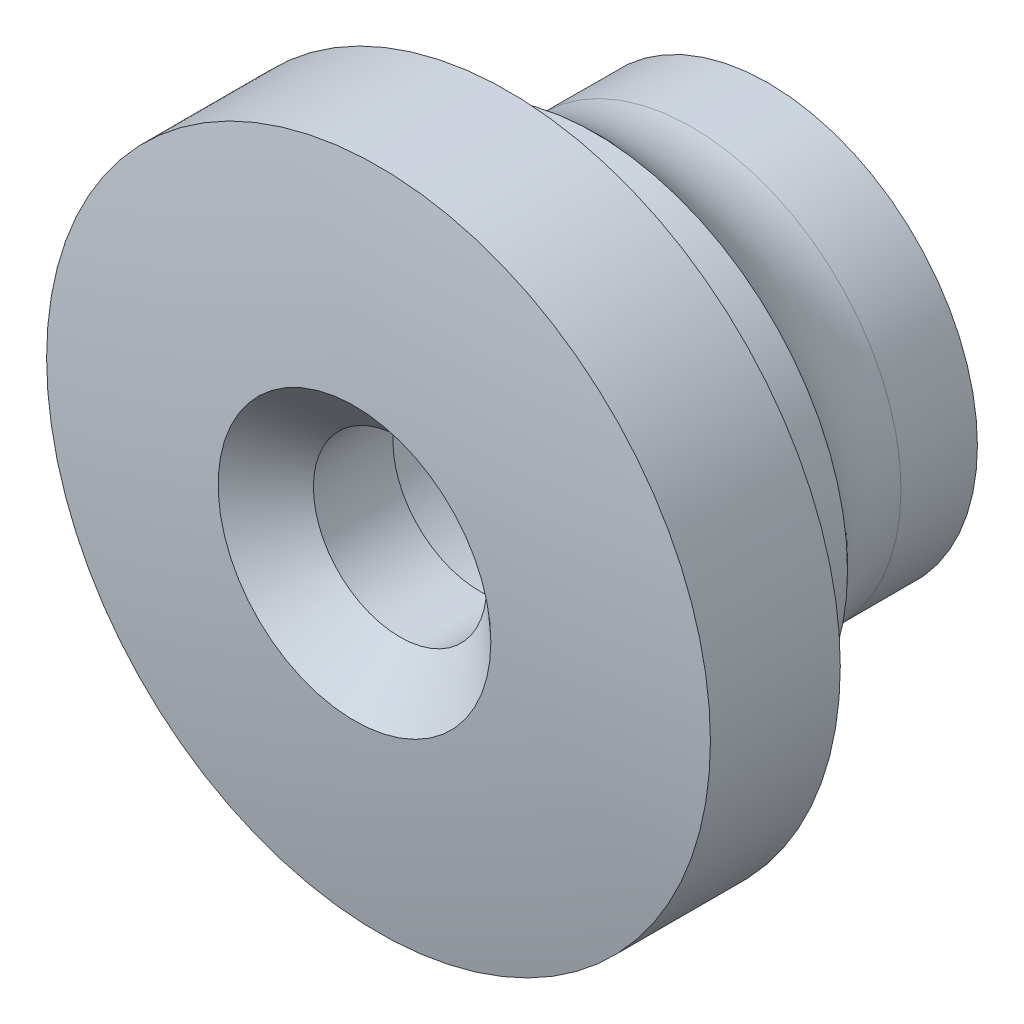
ISO-10303-21;
HEADER;
FILE_DESCRIPTION(('STEP AP214'),'2;1');
FILE_NAME('part.step','',(''),(''),'','','');
FILE_SCHEMA(('AUTOMOTIVE_DESIGN { 1 0 10303 214 1 1 1 1 }'));
ENDSEC;
DATA;
#1=APPLICATION_CONTEXT('core data for automotive mechanical design processes');
#2=APPLICATION_PROTOCOL_DEFINITION('international standard','automotive_design',2000,#1);
#3=PRODUCT_CONTEXT('',#1,'mechanical');
#4=PRODUCT('Part','Part','',(#3));
#5=PRODUCT_RELATED_PRODUCT_CATEGORY('part','',(#4));
#6=PRODUCT_DEFINITION_FORMATION('','',#4);
#7=PRODUCT_DEFINITION_CONTEXT('part definition',#1,'design');
#8=PRODUCT_DEFINITION('design','',#6,#7);
#9=PRODUCT_DEFINITION_SHAPE('','',#8);
#10=(LENGTH_UNIT() NAMED_UNIT(*) SI_UNIT(.MILLI.,.METRE.));
#11=(NAMED_UNIT(*) PLANE_ANGLE_UNIT() SI_UNIT($,.RADIAN.));
#12=(NAMED_UNIT(*) SI_UNIT($,.STERADIAN.) SOLID_ANGLE_UNIT());
#13=UNCERTAINTY_MEASURE_WITH_UNIT(LENGTH_MEASURE(1.E-05),#10,'distance_accuracy_value','');
#14=(GEOMETRIC_REPRESENTATION_CONTEXT(3) GLOBAL_UNCERTAINTY_ASSIGNED_CONTEXT((#13)) GLOBAL_UNIT_ASSIGNED_CONTEXT((#10,
#11,#12)) REPRESENTATION_CONTEXT('',''));
#15=CARTESIAN_POINT('',(0.,0.,0.));
#16=DIRECTION('',(0.,0.,1.));
#17=DIRECTION('',(1.,0.,0.));
#18=AXIS2_PLACEMENT_3D('',#15,#16,#17);
#19=CARTESIAN_POINT('',(0.,0.,0.));
#20=DIRECTION('',(0.,0.,-1.));
#21=DIRECTION('',(-1.,0.,0.));
#22=AXIS2_PLACEMENT_3D('',#19,#20,#21);
#23=CYLINDRICAL_SURFACE('',#22,3.00000000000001);
#24=CARTESIAN_POINT('',(0.,0.,3.75620056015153));
#25=DIRECTION('',(0.,0.,1.));
#26=DIRECTION('',(1.,0.,0.));
#27=AXIS2_PLACEMENT_3D('',#24,#25,#26);
#28=CIRCLE('',#27,3.00000000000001);
#29=CARTESIAN_POINT('',(3.00000000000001,0.,3.75620056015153));
#30=VERTEX_POINT('',#29);
#31=EDGE_CURVE('E51',#30,#30,#28,.T.);
#32=ORIENTED_EDGE('',*,*,#31,.T.);
#33=EDGE_LOOP('',(#32));
#34=FACE_BOUND('',#33,.T.);
#35=CARTESIAN_POINT('',(0.,0.,0.999999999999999));
#36=DIRECTION('',(0.,0.,-1.));
#37=DIRECTION('',(-1.,0.,0.));
#38=AXIS2_PLACEMENT_3D('',#35,#36,#37);
#39=CIRCLE('',#38,3.00000000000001);
#40=CARTESIAN_POINT('',(-3.00000000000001,0.,0.999999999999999));
#41=VERTEX_POINT('',#40);
#42=EDGE_CURVE('E38',#41,#41,#39,.F.);
#43=ORIENTED_EDGE('',*,*,#42,.F.);
#44=EDGE_LOOP('',(#43));
#45=FACE_BOUND('',#44,.T.);
#46=ADVANCED_FACE('F34',(#34,#45),#23,.F.);
#47=CARTESIAN_POINT('',(0.,0.,0.));
#48=DIRECTION('',(0.,0.,1.));
#49=DIRECTION('',(1.,0.,0.));
#50=AXIS2_PLACEMENT_3D('',#47,#48,#49);
#51=PLANE('',#50);
#52=CARTESIAN_POINT('',(0.,0.,0.));
#53=DIRECTION('',(0.,0.,1.));
#54=DIRECTION('',(1.,0.,0.));
#55=AXIS2_PLACEMENT_3D('',#52,#53,#54);
#56=CIRCLE('',#55,11.5);
#57=CARTESIAN_POINT('',(11.5,0.,0.));
#58=VERTEX_POINT('',#57);
#59=EDGE_CURVE('E57',#58,#58,#56,.T.);
#60=ORIENTED_EDGE('',*,*,#59,.F.);
#61=EDGE_LOOP('',(#60));
#62=FACE_BOUND('',#61,.T.);
#63=CARTESIAN_POINT('',(0.,0.,0.));
#64=DIRECTION('',(0.,0.,1.));
#65=DIRECTION('',(1.,0.,0.));
#66=AXIS2_PLACEMENT_3D('',#63,#64,#65);
#67=CIRCLE('',#66,8.75);
#68=CARTESIAN_POINT('',(8.75,0.,0.));
#69=VERTEX_POINT('',#68);
#70=EDGE_CURVE('E42',#69,#69,#67,.F.);
#71=ORIENTED_EDGE('',*,*,#70,.F.);
#72=EDGE_LOOP('',(#71));
#73=FACE_BOUND('',#72,.T.);
#74=ADVANCED_FACE('F79',(#62,#73),#51,.F.);
#75=CARTESIAN_POINT('',(0.,0.,4.5));
#76=DIRECTION('',(0.,0.,-1.));
#77=DIRECTION('',(-1.,0.,0.));
#78=AXIS2_PLACEMENT_3D('',#75,#76,#77);
#79=CYLINDRICAL_SURFACE('',#78,11.5);
#80=CARTESIAN_POINT('',(0.,0.,4.5));
#81=DIRECTION('',(0.,0.,1.));
#82=DIRECTION('',(1.,0.,0.));
#83=AXIS2_PLACEMENT_3D('',#80,#81,#82);
#84=CIRCLE('',#83,11.5);
#85=CARTESIAN_POINT('',(11.5,0.,4.50000000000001));
#86=VERTEX_POINT('',#85);
#87=EDGE_CURVE('E54',#86,#86,#84,.T.);
#88=ORIENTED_EDGE('',*,*,#87,.F.);
#89=EDGE_LOOP('',(#88));
#90=FACE_BOUND('',#89,.T.);
#91=ORIENTED_EDGE('',*,*,#59,.T.);
#92=EDGE_LOOP('',(#91));
#93=FACE_BOUND('',#92,.T.);
#94=ADVANCED_FACE('F85',(#90,#93),#79,.T.);
#95=CARTESIAN_POINT('',(0.,0.,-61.125));
#96=DIRECTION('',(0.,0.,1.));
#97=DIRECTION('',(1.,0.,0.));
#98=AXIS2_PLACEMENT_3D('',#95,#96,#97);
#99=SPHERICAL_SURFACE('',#98,66.625);
#100=CARTESIAN_POINT('',(0.,0.,5.33225349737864));
#101=DIRECTION('',(0.,0.,-1.));
#102=DIRECTION('',(-1.,0.,0.));
#103=AXIS2_PLACEMENT_3D('',#100,#101,#102);
#104=CIRCLE('',#103,4.72483677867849);
#105=CARTESIAN_POINT('',(4.72483677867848,0.,5.33225349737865));
#106=VERTEX_POINT('',#105);
#107=EDGE_CURVE('E46',#106,#106,#104,.T.);
#108=CARTESIAN_POINT('',(4.72483677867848,0.,5.33225349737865));
#109=CARTESIAN_POINT('',(4.79579389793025,0.,5.32720873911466));
#110=CARTESIAN_POINT('',(4.86674293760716,0.,5.32205033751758));
#111=CARTESIAN_POINT('',(5.00862413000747,0.,5.31150630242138));
#112=CARTESIAN_POINT('',(5.07955628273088,0.,5.30612066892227));
#113=CARTESIAN_POINT('',(5.22140297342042,0.,5.29512222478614));
#114=CARTESIAN_POINT('',(5.29231751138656,0.,5.28950941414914));
#115=CARTESIAN_POINT('',(5.43412824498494,0.,5.27805667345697));
#116=CARTESIAN_POINT('',(5.5050244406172,0.,5.2722167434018));
#117=CARTESIAN_POINT('',(5.64679776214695,0.,5.26030982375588));
#118=CARTESIAN_POINT('',(5.71767488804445,0.,5.25424283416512));
#119=CARTESIAN_POINT('',(5.85940934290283,0.,5.24188185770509));
#120=CARTESIAN_POINT('',(5.93026667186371,0.,5.23558787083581));
#121=CARTESIAN_POINT('',(6.0719608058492,0.,5.22277296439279));
#122=CARTESIAN_POINT('',(6.14279761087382,0.,5.21625204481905));
#123=CARTESIAN_POINT('',(6.28444997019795,0.,5.20298333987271));
#124=CARTESIAN_POINT('',(6.35526552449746,0.,5.19623555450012));
#125=CARTESIAN_POINT('',(6.49687465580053,0.,5.18251318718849));
#126=CARTESIAN_POINT('',(6.56766823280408,0.,5.17553860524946));
#127=CARTESIAN_POINT('',(6.70923268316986,0.,5.16136271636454));
#128=CARTESIAN_POINT('',(6.7800035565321,0.,5.15416140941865));
#129=CARTESIAN_POINT('',(6.92152187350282,0.,5.13953214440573));
#130=CARTESIAN_POINT('',(6.99226931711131,0.,5.1321041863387));
#131=CARTESIAN_POINT('',(7.13374004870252,0.,5.11702169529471));
#132=CARTESIAN_POINT('',(7.20446333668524,0.,5.10936716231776));
#133=CARTESIAN_POINT('',(7.34588503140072,0.,5.09383159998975));
#134=CARTESIAN_POINT('',(7.41658343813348,0.,5.0859505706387));
#135=CARTESIAN_POINT('',(7.55795464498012,0.,5.06996209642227));
#136=CARTESIAN_POINT('',(7.628627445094,0.,5.06185465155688));
#137=CARTESIAN_POINT('',(7.7699467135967,0.,5.0454134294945));
#138=CARTESIAN_POINT('',(7.84059318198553,0.,5.0370796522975));
#139=CARTESIAN_POINT('',(7.9818590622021,0.,5.02018585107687));
#140=CARTESIAN_POINT('',(8.05247847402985,0.,5.01162582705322));
#141=CARTESIAN_POINT('',(8.19368951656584,0.,4.99427962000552));
#142=CARTESIAN_POINT('',(8.26428114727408,0.,4.98549343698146));
#143=CARTESIAN_POINT('',(8.4054359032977,0.,4.96769500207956));
#144=CARTESIAN_POINT('',(8.47599902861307,0.,4.95868275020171));
#145=CARTESIAN_POINT('',(8.61709604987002,0.,4.94043227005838));
#146=CARTESIAN_POINT('',(8.68762994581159,0.,4.9311940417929));
#147=CARTESIAN_POINT('',(8.82866778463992,0.,4.91249170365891));
#148=CARTESIAN_POINT('',(8.89917172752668,0.,4.90302759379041));
#149=CARTESIAN_POINT('',(9.04014893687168,0.,4.8838735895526));
#150=CARTESIAN_POINT('',(9.11062220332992,0.,4.87418369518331));
#151=CARTESIAN_POINT('',(9.25153733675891,0.,4.85457822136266));
#152=CARTESIAN_POINT('',(9.32197920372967,0.,4.84466264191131));
#153=CARTESIAN_POINT('',(9.46283081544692,0.,4.82460589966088));
#154=CARTESIAN_POINT('',(9.5332405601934,0.,4.81446473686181));
#155=CARTESIAN_POINT('',(9.67402720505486,0.,4.79395693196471));
#156=CARTESIAN_POINT('',(9.74440410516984,0.,4.78359028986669));
#157=CARTESIAN_POINT('',(9.88512433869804,0.,4.7626316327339));
#158=CARTESIAN_POINT('',(9.95546767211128,0.,4.75203961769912));
#159=CARTESIAN_POINT('',(10.0961200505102,0.,4.73063032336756));
#160=CARTESIAN_POINT('',(10.1664290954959,0.,4.71981304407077));
#161=CARTESIAN_POINT('',(10.3070121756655,0.,4.6979533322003));
#162=CARTESIAN_POINT('',(10.3772862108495,0.,4.68691089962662));
#163=CARTESIAN_POINT('',(10.5177985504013,0.,4.66460099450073));
#164=CARTESIAN_POINT('',(10.5880368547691,0.,4.65333352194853));
#165=CARTESIAN_POINT('',(10.7284770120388,0.,4.63057365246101));
#166=CARTESIAN_POINT('',(10.7986788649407,0.,4.61908125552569));
#167=CARTESIAN_POINT('',(10.9390453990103,0.,4.59587165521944));
#168=CARTESIAN_POINT('',(11.0092100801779,0.,4.58415445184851));
#169=CARTESIAN_POINT('',(11.1495015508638,0.,4.56049535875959));
#170=CARTESIAN_POINT('',(11.219628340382,0.,4.54855346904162));
#171=CARTESIAN_POINT('',(11.3598433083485,0.,4.52444512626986));
#172=CARTESIAN_POINT('',(11.4299314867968,0.,4.51227867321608));
#173=CARTESIAN_POINT('',(11.5,0.,4.50000000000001));
#174=B_SPLINE_CURVE_WITH_KNOTS('',3,(#108,#109,#110,#111,#112,#113,#114,#115,#116,#117,#118,
#119,#120,#121,#122,#123,#124,#125,#126,#127,#128,#129,#130,#131,#132,#133,#134,#135,#136,#137,
#138,#139,#140,#141,#142,#143,#144,#145,#146,#147,#148,#149,#150,#151,#152,#153,#154,#155,#156,
#157,#158,#159,#160,#161,#162,#163,#164,#165,#166,#167,#168,#169,#170,#171,#172,#173),
.UNSPECIFIED.,.F.,.F.,(4,2,2,2,2,2,2,2,2,2,2,2,2,2,2,2,2,2,2,2,2,2,2,2,2,2,2,2,2,2,2,2,4),(0.,
0.213408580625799,0.426817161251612,0.640225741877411,0.853634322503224,1.06704290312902,
1.28045148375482,1.49386006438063,1.70726864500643,1.92067722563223,2.13408580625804,
2.34749438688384,2.56090296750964,2.77431154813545,2.98772012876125,3.20112870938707,
3.41453729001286,3.62794587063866,3.84135445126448,4.05476303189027,4.26817161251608,
4.48158019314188,4.69498877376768,4.9083973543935,5.12180593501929,5.33521451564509,
5.54862309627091,5.7620316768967,5.9754402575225,6.18884883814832,6.40225741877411,
6.61566599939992,6.82907458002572),.UNSPECIFIED.);
#175=EDGE_CURVE('BSEAM94',#106,#86,#174,.T.);
#176=ORIENTED_EDGE('',*,*,#107,.T.);
#177=ORIENTED_EDGE('',*,*,#87,.T.);
#178=ORIENTED_EDGE('',*,*,#175,.T.);
#179=ORIENTED_EDGE('',*,*,#175,.F.);
#180=EDGE_LOOP('',(#176,#178,#177,#179));
#181=FACE_BOUND('',#180,.T.);
#182=ADVANCED_FACE('F94',(#181),#99,.T.);
#183=CARTESIAN_POINT('',(0.,0.,3.75620056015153));
#184=DIRECTION('',(0.,0.,1.));
#185=DIRECTION('',(1.,0.,0.));
#186=AXIS2_PLACEMENT_3D('',#183,#184,#185);
#187=CONICAL_SURFACE('',#186,3.00000000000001,0.830441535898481);
#188=ORIENTED_EDGE('',*,*,#107,.F.);
#189=EDGE_LOOP('',(#188));
#190=FACE_BOUND('',#189,.T.);
#191=ORIENTED_EDGE('',*,*,#31,.F.);
#192=EDGE_LOOP('',(#191));
#193=FACE_BOUND('',#192,.T.);
#194=ADVANCED_FACE('F97',(#190,#193),#187,.F.);
#195=CARTESIAN_POINT('',(0.,0.,-3.));
#196=DIRECTION('',(0.,0.,1.));
#197=DIRECTION('',(1.,0.,0.));
#198=AXIS2_PLACEMENT_3D('',#195,#196,#197);
#199=CYLINDRICAL_SURFACE('',#198,8.75);
#200=CARTESIAN_POINT('',(0.,0.,-3.));
#201=DIRECTION('',(0.,0.,-1.));
#202=DIRECTION('',(-1.,0.,0.));
#203=AXIS2_PLACEMENT_3D('',#200,#201,#202);
#204=CIRCLE('',#203,8.75);
#205=CARTESIAN_POINT('',(-8.75,0.,-3.));
#206=VERTEX_POINT('',#205);
#207=EDGE_CURVE('E60',#206,#206,#204,.T.);
#208=ORIENTED_EDGE('',*,*,#207,.F.);
#209=EDGE_LOOP('',(#208));
#210=FACE_BOUND('',#209,.T.);
#211=ORIENTED_EDGE('',*,*,#70,.T.);
#212=EDGE_LOOP('',(#211));
#213=FACE_BOUND('',#212,.T.);
#214=ADVANCED_FACE('F89',(#210,#213),#199,.T.);
#215=CARTESIAN_POINT('',(0.,0.,-9.));
#216=DIRECTION('',(0.,0.,1.));
#217=DIRECTION('',(1.,0.,0.));
#218=AXIS2_PLACEMENT_3D('',#215,#216,#217);
#219=CYLINDRICAL_SURFACE('',#218,7.25);
#220=CARTESIAN_POINT('',(0.,0.,-6.35410196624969));
#221=DIRECTION('',(0.,0.,1.));
#222=DIRECTION('',(1.,0.,0.));
#223=AXIS2_PLACEMENT_3D('',#220,#221,#222);
#224=CIRCLE('',#223,7.25);
#225=CARTESIAN_POINT('',(7.25,0.,-6.35410196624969));
#226=VERTEX_POINT('',#225);
#227=EDGE_CURVE('E10',#226,#226,#224,.F.);
#228=ORIENTED_EDGE('',*,*,#227,.T.);
#229=EDGE_LOOP('',(#228));
#230=FACE_BOUND('',#229,.T.);
#231=CARTESIAN_POINT('',(0.,0.,-9.));
#232=DIRECTION('',(0.,0.,-1.));
#233=DIRECTION('',(-1.,0.,0.));
#234=AXIS2_PLACEMENT_3D('',#231,#232,#233);
#235=CIRCLE('',#234,7.25);
#236=CARTESIAN_POINT('',(-7.25,0.,-9.));
#237=VERTEX_POINT('',#236);
#238=EDGE_CURVE('E63',#237,#237,#235,.T.);
#239=ORIENTED_EDGE('',*,*,#238,.F.);
#240=EDGE_LOOP('',(#239));
#241=FACE_BOUND('',#240,.T.);
#242=ADVANCED_FACE('F104',(#230,#241),#219,.T.);
#243=CARTESIAN_POINT('',(0.,0.,-9.));
#244=DIRECTION('',(0.,0.,-1.));
#245=DIRECTION('',(-1.,0.,0.));
#246=AXIS2_PLACEMENT_3D('',#243,#244,#245);
#247=PLANE('',#246);
#248=CARTESIAN_POINT('',(0.,0.,-9.));
#249=DIRECTION('',(0.,0.,-1.));
#250=DIRECTION('',(-1.,0.,0.));
#251=AXIS2_PLACEMENT_3D('',#248,#249,#250);
#252=CIRCLE('',#251,4.5);
#253=CARTESIAN_POINT('',(-4.5,0.,-9.));
#254=VERTEX_POINT('',#253);
#255=EDGE_CURVE('E66',#254,#254,#252,.T.);
#256=ORIENTED_EDGE('',*,*,#255,.F.);
#257=EDGE_LOOP('',(#256));
#258=FACE_BOUND('',#257,.T.);
#259=ORIENTED_EDGE('',*,*,#238,.T.);
#260=EDGE_LOOP('',(#259));
#261=FACE_BOUND('',#260,.T.);
#262=ADVANCED_FACE('F119',(#258,#261),#247,.T.);
#263=CARTESIAN_POINT('',(0.,0.,-6.35410196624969));
#264=DIRECTION('',(0.,0.,1.));
#265=DIRECTION('',(1.,0.,0.));
#266=AXIS2_PLACEMENT_3D('',#263,#264,#265);
#267=TOROIDAL_SURFACE('',#266,11.75,4.5);
#268=ORIENTED_EDGE('',*,*,#207,.T.);
#269=EDGE_LOOP('',(#268));
#270=FACE_BOUND('',#269,.T.);
#271=ORIENTED_EDGE('',*,*,#227,.F.);
#272=EDGE_LOOP('',(#271));
#273=FACE_BOUND('',#272,.T.);
#274=ADVANCED_FACE('F36',(#270,#273),#267,.F.);
#275=CARTESIAN_POINT('',(0.,0.,0.999999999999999));
#276=DIRECTION('',(0.,0.,-1.));
#277=DIRECTION('',(-1.,0.,0.));
#278=AXIS2_PLACEMENT_3D('',#275,#276,#277);
#279=PLANE('',#278);
#280=CARTESIAN_POINT('',(0.,0.,0.999999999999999));
#281=DIRECTION('',(0.,0.,-1.));
#282=DIRECTION('',(-1.,0.,0.));
#283=AXIS2_PLACEMENT_3D('',#280,#281,#282);
#284=CIRCLE('',#283,4.5);
#285=CARTESIAN_POINT('',(-4.5,0.,0.999999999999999));
#286=VERTEX_POINT('',#285);
#287=EDGE_CURVE('E69',#286,#286,#284,.T.);
#288=ORIENTED_EDGE('',*,*,#287,.T.);
#289=EDGE_LOOP('',(#288));
#290=FACE_BOUND('',#289,.T.);
#291=ORIENTED_EDGE('',*,*,#42,.T.);
#292=EDGE_LOOP('',(#291));
#293=FACE_BOUND('',#292,.T.);
#294=ADVANCED_FACE('F76',(#290,#293),#279,.T.);
#295=CARTESIAN_POINT('',(0.,0.,0.999999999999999));
#296=DIRECTION('',(0.,0.,-1.));
#297=DIRECTION('',(-1.,0.,0.));
#298=AXIS2_PLACEMENT_3D('',#295,#296,#297);
#299=CYLINDRICAL_SURFACE('',#298,4.5);
#300=ORIENTED_EDGE('',*,*,#287,.F.);
#301=EDGE_LOOP('',(#300));
#302=FACE_BOUND('',#301,.T.);
#303=ORIENTED_EDGE('',*,*,#255,.T.);
#304=EDGE_LOOP('',(#303));
#305=FACE_BOUND('',#304,.T.);
#306=ADVANCED_FACE('F128',(#302,#305),#299,.F.);
#307=CLOSED_SHELL('',(#46,#74,#94,#182,#194,#214,#242,#262,#274,#294,#306));
#308=MANIFOLD_SOLID_BREP('B2',#307);
#309=ADVANCED_BREP_SHAPE_REPRESENTATION('',(#18,#308),#14);
#310=SHAPE_DEFINITION_REPRESENTATION(#9,#309);
ENDSEC;
END-ISO-10303-21;
